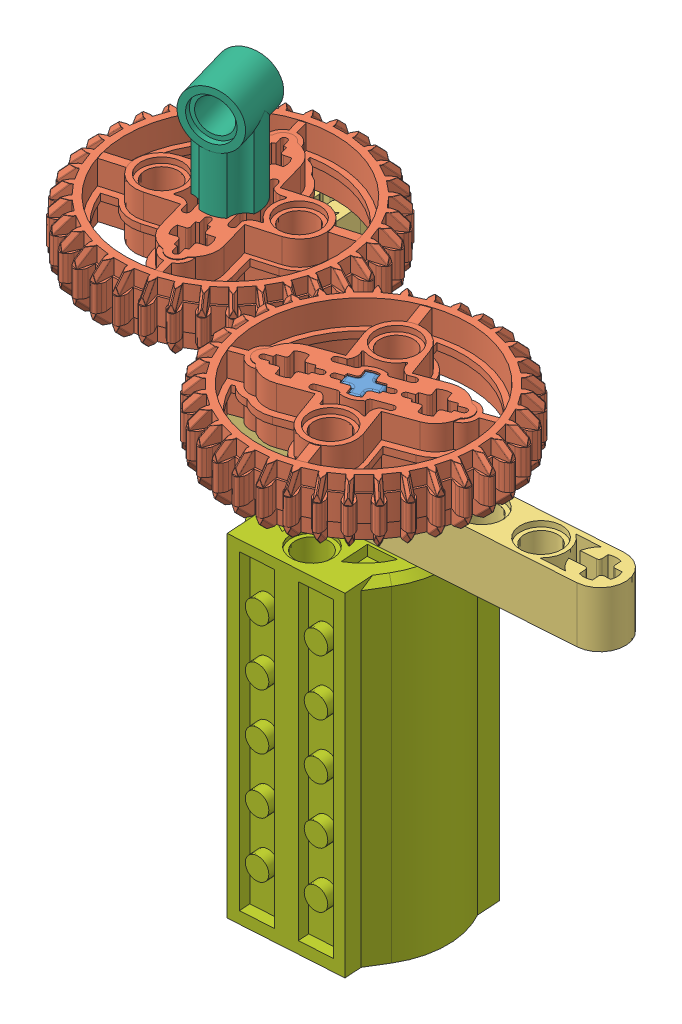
SolidWorks assembly 12.SLDASM, configuration 기본 (file format 9000). Lengths in mm.
Overall size (91.94 80.06 61.96).
10 component instances, 8 part files, 24 mates.
Components (placement in the parent):
- 4519 Axle 3-1: 4519 Axle 3.SLDPRT [기본] at (24.9263 -15.0589 24.0072) x (0.93893 0 -0.344108) z (0.344108 0 0.93893) size (4.8 24.01 4.8)
- 32498 Gear 36 double bevel-1: 32498 Gear 36 double bevel.SLDPRT [기본] at (24.9263 4.9086 24.0072) x (-0.344108 0 -0.93893) z (0.93893 0 -0.344108) size (37.47 8.22 37.47)
- 32009 Liftarm 1 x 11.5 Double Bent Thick-1: 32009 Liftarm 1 x 11.5 Double Bent Thick.SLDPRT [기본] at (37.4758 -7.1239 23.1581) x (0.997719 0 -0.067505) z (0.067505 0 0.997719) size (71.2 8 39.2)
- 2780 Pin with Friction Ridges Lengthwise WITH Center Slots-1: 2780 Pin with Friction Ridges Lengthwise WITH Center Slots.SLDPRT [기본] at (32.9081 -7.1239 23.4672) x (0.998853 0 0.047889) z (-0.047889 0 0.998853) size (6 16 5.88)
- 6587 Axle3 w stud-1: 6587 Axle3 w stud.SLDPRT [기본] at (-8.0808 -6.3239 10.2039) x (0.275516 0 0.961296) z (-0.961296 0 0.275516) size (6 26.4 6)
- 32013 Axle pin connector angled #1-1: 32013 Axle pin connector angled #1.SLDPRT [기본] at (-8.0808 8.9411 10.2039) x (0 -1 0) z (0.275516 0 0.961296) size (16 8 8)
- 2780 Pin with Friction Ridges Lengthwise WITH Center Slots-2: 2780 Pin with Friction Ridges Lengthwise WITH Center Slots.SLDPRT [기본] at (16.9446 -7.1239 24.5472) x (-0.985717 0 -0.168409) z (0.168409 0 -0.985717) size (6 16 5.88)
- 32498 Gear 36 double bevel-2: 32498 Gear 36 double bevel.SLDPRT [기본] at (-8.0808 4.9086 10.2039) x (0.961296 0 -0.275516) z (0.275516 0 0.961296) size (37.47 8.22 37.47)
- 9V Motor M-2: 9V Motor M.SLDPRT [기본] at (24.9612 -31.1239 24.005) x (0.998005 0 -0.06314) z (0 1 0) size (24 24 48.27)
- Motor 9V  PF Medium part-2: Motor 9V  PF Medium part.SLDPRT [기본] at (25.1035 -15.0589 26.0631) x (0.344108 0 0.93893) z (0 1 0) size (7 7 8)
Mates (geometry in assembly coordinates):
- 동심1: concentric: cylinder of 4519 Axle 3-1 through (24.9263 8.9411 24.0072) axis (0 -1 0) radius 2.4; cylinder of 32498 Gear 36 double bevel-1 through (24.9263 -7.9779 24.0072) axis (0 1 0) radius 2.4
- 일치1: coincident: plane of 4519 Axle 3-1 through (24.9263 8.9411 24.0072) normal (0 1 0); plane of 32498 Gear 36 double bevel-1 through (36.344 8.9411 10.1816) normal (0 1 0)
- 동심2: concentric: cylinder of 4519 Axle 3-1 through (26.2846 8.9411 25.2038) axis (0 1 0) radius 0.4; cylinder of 32498 Gear 36 double bevel-1 through (26.2846 -7.9779 25.2038) axis (0 1 0) radius 0.4
- 동심3: concentric: cylinder of 4519 Axle 3-1 through (24.9263 8.9411 24.0072) axis (0 -1 0) radius 2.4; cylinder of 32009 Liftarm 1 x 11.5 Double Bent Thick-1 through (24.9263 0.8761 24.0072) axis (0 -1 0) radius 2.3851
- 일치2: coincident: plane of 32498 Gear 36 double bevel-1 through (36.344 0.8761 10.1816) normal (0 -1 0); plane of 32009 Liftarm 1 x 11.5 Double Bent Thick-1 through (-9.1608 0.8761 -5.7596) normal (0 1 0)
- 동심4: concentric: cylinder of 32009 Liftarm 1 x 11.5 Double Bent Thick-1 through (32.9081 0.8761 23.4672) axis (0 -1 0) radius 2.3851; cylinder of 2780 Pin with Friction Ridges Lengthwise WITH Center Slots-1 through (32.9081 -15.1239 23.4672) axis (0 1 0) radius 2.4
- 일치3: coincident: plane of 32009 Liftarm 1 x 11.5 Double Bent Thick-1 through (32.9081 -6.3239 23.4672) normal (0 -1 0); plane of 2780 Pin with Friction Ridges Lengthwise WITH Center Slots-1 through (32.9081 -6.3239 23.4672) normal (0 1 0)
- 동심5: concentric: cylinder of 32009 Liftarm 1 x 11.5 Double Bent Thick-1 through (16.9446 0.8761 24.5472) axis (0 -1 0) radius 2.3851; cylinder of 2780 Pin with Friction Ridges Lengthwise WITH Center Slots-2 through (16.9446 -15.1239 24.5472) axis (0 1 0) radius 2.4
- 일치4: coincident: plane of 32009 Liftarm 1 x 11.5 Double Bent Thick-1 through (16.9446 -6.3239 24.5472) normal (0 -1 0); plane of 2780 Pin with Friction Ridges Lengthwise WITH Center Slots-2 through (16.9446 -6.3239 24.5472) normal (0 1 0)
- 일치6: coincident: plane of 32009 Liftarm 1 x 11.5 Double Bent Thick-1 through (-9.1608 0.8761 -5.7596) normal (0 1 0); plane of 32498 Gear 36 double bevel-2 through (-6.127 0.8761 28.0278) normal (0 -1 0)
- 일치7: coincident: plane of 32013 Axle pin connector angled #1-1 through (-8.299 8.9411 7.3839) normal (0 -1 0); plane of 32498 Gear 36 double bevel-2 through (-6.127 8.9411 28.0278) normal (0 1 0)
- 일치18: coincident: plane of 4519 Axle 3-1 through (22.7535 8.9411 25.0264) normal (0.06313 0 0.998005); plane of Motor 9V  PF Medium part-2 through (22.7535 -7.0589 25.0264) normal (-0.06313 0 -0.998005)
- 평행11: parallel: plane of 4519 Axle 3-1 through (24.1891 8.9411 26.2912) normal (-0.998005 0 0.06313); plane of Motor 9V  PF Medium part-2 through (24.1289 -7.0589 25.3402) normal (0.998005 0 -0.06313)
- 일치20: coincident: plane of 32009 Liftarm 1 x 11.5 Double Bent Thick-1 through (-9.1608 -7.1239 -5.7596) normal (0 -1 0); plane of 9V Motor M-2 through (24.9612 -7.1239 24.005) normal (0 1 0)
- 동심28: concentric: cylinder of 4519 Axle 3-1 through (23.7297 8.9411 25.3655) axis (0 1 0) radius 0.4; cylinder of Motor 9V  PF Medium part-2 through (23.7297 -7.0589 25.3655) axis (0 -1 0) radius 0.4
- 일치21: coincident: plane of 4519 Axle 3-1 through (24.9263 -15.0589 24.0072) normal (0 -1 0); plane of Motor 9V  PF Medium part-2 through (24.9263 -15.0589 24.0072) normal (0 -1 0)
- 동심29: concentric: cylinder of 2780 Pin with Friction Ridges Lengthwise WITH Center Slots-2 through (16.9446 -15.1239 24.5472) axis (0 1 0) radius 2.4; cylinder of 9V Motor M-2 through (16.9444 -7.1239 24.5473) axis (0 1 0) radius 2.4
- 동심30: concentric: cylinder of 2780 Pin with Friction Ridges Lengthwise WITH Center Slots-1 through (32.9081 -15.1239 23.4672) axis (0 1 0) radius 2.4; cylinder of 9V Motor M-2 through (32.9081 -7.1239 23.4672) axis (0 1 0) radius 2.4
- 동심31: concentric: cylinder of 32009 Liftarm 1 x 11.5 Double Bent Thick-1 through (-8.0808 0.8761 10.2039) axis (0 -1 0) radius 2.4; cylinder of 6587 Axle3 w stud-1 through (-8.0808 17.6761 10.2039) axis (0 -1 0) radius 2.4
- 일치22: coincident: plane of 32009 Liftarm 1 x 11.5 Double Bent Thick-1 through (-8.0808 -6.3239 10.2039) normal (0 -1 0); plane of 6587 Axle3 w stud-1 through (-8.0808 -6.3239 10.2039) normal (0 1 0)
- 동심32: concentric: cylinder of 6587 Axle3 w stud-1 through (-8.0808 17.6761 10.2039) axis (0 -1 0) radius 2.4; cylinder of 32498 Gear 36 double bevel-2 through (-8.0808 -7.9779 10.2039) axis (0 1 0) radius 2.4
- 일치23: coincident: plane of 6587 Axle3 w stud-1 through (-6.84 17.6761 10.1078) normal (0.759568 0 0.650428); plane of 32498 Gear 36 double bevel-2 through (-6.5798 -7.9779 9.804) normal (-0.759568 0 -0.650428)
- 동심33: concentric: cylinder of 6587 Axle3 w stud-1 through (-8.0808 17.6761 10.2039) axis (0 -1 0) radius 2.4; cylinder of 32013 Axle pin connector angled #1-1 through (-8.0808 24.9421 10.2039) axis (0 -1 0) radius 2.4
- 평행12: parallel: plane of 6587 Axle3 w stud-1 through (-6.84 17.6761 10.1078) normal (0.759568 0 0.650428); plane of 32013 Axle pin connector angled #1-1 through (-5.96 24.9421 9.0803) normal (-0.759568 0 -0.650428)
